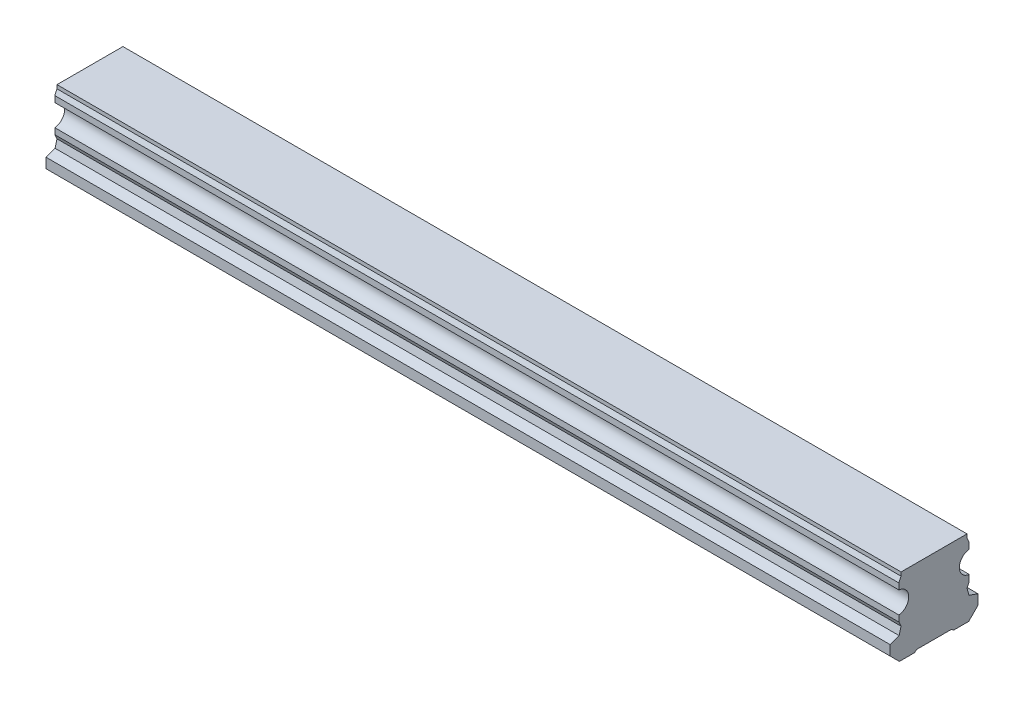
ISO-10303-21;
HEADER;
FILE_DESCRIPTION(('STEP AP214'),'2;1');
FILE_NAME('part.step','',(''),(''),'','','');
FILE_SCHEMA(('AUTOMOTIVE_DESIGN { 1 0 10303 214 1 1 1 1 }'));
ENDSEC;
DATA;
#1=APPLICATION_CONTEXT('core data for automotive mechanical design processes');
#2=APPLICATION_PROTOCOL_DEFINITION('international standard','automotive_design',2000,#1);
#3=PRODUCT_CONTEXT('',#1,'mechanical');
#4=PRODUCT('Part','Part','',(#3));
#5=PRODUCT_RELATED_PRODUCT_CATEGORY('part','',(#4));
#6=PRODUCT_DEFINITION_FORMATION('','',#4);
#7=PRODUCT_DEFINITION_CONTEXT('part definition',#1,'design');
#8=PRODUCT_DEFINITION('design','',#6,#7);
#9=PRODUCT_DEFINITION_SHAPE('','',#8);
#10=(LENGTH_UNIT() NAMED_UNIT(*) SI_UNIT(.MILLI.,.METRE.));
#11=(NAMED_UNIT(*) PLANE_ANGLE_UNIT() SI_UNIT($,.RADIAN.));
#12=(NAMED_UNIT(*) SI_UNIT($,.STERADIAN.) SOLID_ANGLE_UNIT());
#13=UNCERTAINTY_MEASURE_WITH_UNIT(LENGTH_MEASURE(1.E-05),#10,'distance_accuracy_value','');
#14=(GEOMETRIC_REPRESENTATION_CONTEXT(3) GLOBAL_UNCERTAINTY_ASSIGNED_CONTEXT((#13)) GLOBAL_UNIT_ASSIGNED_CONTEXT((#10,
#11,#12)) REPRESENTATION_CONTEXT('',''));
#15=CARTESIAN_POINT('',(0.,0.,0.));
#16=DIRECTION('',(0.,0.,1.));
#17=DIRECTION('',(1.,0.,0.));
#18=AXIS2_PLACEMENT_3D('',#15,#16,#17);
#19=CARTESIAN_POINT('',(210.,0.499999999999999,0.));
#20=DIRECTION('',(0.,-1.,0.));
#21=DIRECTION('',(0.,0.,-1.));
#22=AXIS2_PLACEMENT_3D('',#19,#20,#21);
#23=CONICAL_SURFACE('',#22,3.5,0.785398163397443);
#24=CARTESIAN_POINT('',(210.,1.00000000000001,0.));
#25=DIRECTION('',(0.,1.,0.));
#26=DIRECTION('',(0.,0.,1.));
#27=AXIS2_PLACEMENT_3D('',#24,#25,#26);
#28=CIRCLE('',#27,3.);
#29=CARTESIAN_POINT('',(210.,1.00000000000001,3.));
#30=VERTEX_POINT('',#29);
#31=EDGE_CURVE('E11',#30,#30,#28,.F.);
#32=ORIENTED_EDGE('',*,*,#31,.F.);
#33=EDGE_LOOP('',(#32));
#34=FACE_BOUND('',#33,.T.);
#35=CARTESIAN_POINT('',(210.,0.499999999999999,0.));
#36=DIRECTION('',(0.,1.,0.));
#37=DIRECTION('',(0.,0.,1.));
#38=AXIS2_PLACEMENT_3D('',#35,#36,#37);
#39=CIRCLE('',#38,3.5);
#40=CARTESIAN_POINT('',(210.,0.5,3.5));
#41=VERTEX_POINT('',#40);
#42=EDGE_CURVE('E447',#41,#41,#39,.T.);
#43=ORIENTED_EDGE('',*,*,#42,.F.);
#44=EDGE_LOOP('',(#43));
#45=FACE_BOUND('',#44,.T.);
#46=ADVANCED_FACE('F39',(#34,#45),#23,.F.);
#47=CARTESIAN_POINT('',(210.,12.,0.));
#48=DIRECTION('',(0.,-1.,0.));
#49=DIRECTION('',(0.,0.,-1.));
#50=AXIS2_PLACEMENT_3D('',#47,#48,#49);
#51=CYLINDRICAL_SURFACE('',#50,3.);
#52=ORIENTED_EDGE('',*,*,#31,.T.);
#53=EDGE_LOOP('',(#52));
#54=FACE_BOUND('',#53,.T.);
#55=CARTESIAN_POINT('',(210.,12.,0.));
#56=DIRECTION('',(0.,-1.,0.));
#57=DIRECTION('',(0.,0.,-1.));
#58=AXIS2_PLACEMENT_3D('',#55,#56,#57);
#59=CIRCLE('',#58,3.);
#60=CARTESIAN_POINT('',(210.,12.,-3.));
#61=VERTEX_POINT('',#60);
#62=EDGE_CURVE('E49',#61,#61,#59,.T.);
#63=ORIENTED_EDGE('',*,*,#62,.F.);
#64=EDGE_LOOP('',(#63));
#65=FACE_BOUND('',#64,.T.);
#66=ADVANCED_FACE('F587',(#54,#65),#51,.F.);
#67=CARTESIAN_POINT('',(210.,12.,0.));
#68=DIRECTION('',(0.,-1.,0.));
#69=DIRECTION('',(0.,0.,-1.));
#70=AXIS2_PLACEMENT_3D('',#67,#68,#69);
#71=PLANE('',#70);
#72=CARTESIAN_POINT('',(210.,12.,0.));
#73=DIRECTION('',(0.,-1.,0.));
#74=DIRECTION('',(0.,0.,-1.));
#75=AXIS2_PLACEMENT_3D('',#72,#73,#74);
#76=CIRCLE('',#75,2.5);
#77=CARTESIAN_POINT('',(210.,12.,-2.5));
#78=VERTEX_POINT('',#77);
#79=EDGE_CURVE('E42',#78,#78,#76,.T.);
#80=ORIENTED_EDGE('',*,*,#79,.F.);
#81=EDGE_LOOP('',(#80));
#82=FACE_BOUND('',#81,.T.);
#83=ORIENTED_EDGE('',*,*,#62,.T.);
#84=EDGE_LOOP('',(#83));
#85=FACE_BOUND('',#84,.T.);
#86=ADVANCED_FACE('F592',(#82,#85),#71,.T.);
#87=CARTESIAN_POINT('',(150.,0.499999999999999,0.));
#88=DIRECTION('',(0.,-1.,0.));
#89=DIRECTION('',(0.,0.,-1.));
#90=AXIS2_PLACEMENT_3D('',#87,#88,#89);
#91=CONICAL_SURFACE('',#90,3.5,0.785398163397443);
#92=CARTESIAN_POINT('',(150.,1.00000000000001,0.));
#93=DIRECTION('',(0.,1.,0.));
#94=DIRECTION('',(0.,0.,1.));
#95=AXIS2_PLACEMENT_3D('',#92,#93,#94);
#96=CIRCLE('',#95,3.);
#97=CARTESIAN_POINT('',(150.,1.00000000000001,3.));
#98=VERTEX_POINT('',#97);
#99=EDGE_CURVE('E443',#98,#98,#96,.F.);
#100=ORIENTED_EDGE('',*,*,#99,.F.);
#101=EDGE_LOOP('',(#100));
#102=FACE_BOUND('',#101,.T.);
#103=CARTESIAN_POINT('',(150.,0.499999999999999,0.));
#104=DIRECTION('',(0.,1.,0.));
#105=DIRECTION('',(0.,0.,1.));
#106=AXIS2_PLACEMENT_3D('',#103,#104,#105);
#107=CIRCLE('',#106,3.5);
#108=CARTESIAN_POINT('',(150.,0.5,3.5));
#109=VERTEX_POINT('',#108);
#110=EDGE_CURVE('E435',#109,#109,#107,.T.);
#111=ORIENTED_EDGE('',*,*,#110,.F.);
#112=EDGE_LOOP('',(#111));
#113=FACE_BOUND('',#112,.T.);
#114=ADVANCED_FACE('F679',(#102,#113),#91,.F.);
#115=CARTESIAN_POINT('',(150.,12.,0.));
#116=DIRECTION('',(0.,-1.,0.));
#117=DIRECTION('',(0.,0.,-1.));
#118=AXIS2_PLACEMENT_3D('',#115,#116,#117);
#119=CYLINDRICAL_SURFACE('',#118,3.);
#120=ORIENTED_EDGE('',*,*,#99,.T.);
#121=EDGE_LOOP('',(#120));
#122=FACE_BOUND('',#121,.T.);
#123=CARTESIAN_POINT('',(150.,12.,0.));
#124=DIRECTION('',(0.,-1.,0.));
#125=DIRECTION('',(0.,0.,-1.));
#126=AXIS2_PLACEMENT_3D('',#123,#124,#125);
#127=CIRCLE('',#126,3.);
#128=CARTESIAN_POINT('',(150.,12.,-3.));
#129=VERTEX_POINT('',#128);
#130=EDGE_CURVE('E439',#129,#129,#127,.T.);
#131=ORIENTED_EDGE('',*,*,#130,.F.);
#132=EDGE_LOOP('',(#131));
#133=FACE_BOUND('',#132,.T.);
#134=ADVANCED_FACE('F675',(#122,#133),#119,.F.);
#135=CARTESIAN_POINT('',(150.,12.,0.));
#136=DIRECTION('',(0.,-1.,0.));
#137=DIRECTION('',(0.,0.,-1.));
#138=AXIS2_PLACEMENT_3D('',#135,#136,#137);
#139=PLANE('',#138);
#140=CARTESIAN_POINT('',(150.,12.,0.));
#141=DIRECTION('',(0.,-1.,0.));
#142=DIRECTION('',(0.,0.,-1.));
#143=AXIS2_PLACEMENT_3D('',#140,#141,#142);
#144=CIRCLE('',#143,2.5);
#145=CARTESIAN_POINT('',(150.,12.,-2.5));
#146=VERTEX_POINT('',#145);
#147=EDGE_CURVE('E456',#146,#146,#144,.T.);
#148=ORIENTED_EDGE('',*,*,#147,.F.);
#149=EDGE_LOOP('',(#148));
#150=FACE_BOUND('',#149,.T.);
#151=ORIENTED_EDGE('',*,*,#130,.T.);
#152=EDGE_LOOP('',(#151));
#153=FACE_BOUND('',#152,.T.);
#154=ADVANCED_FACE('F665',(#150,#153),#139,.T.);
#155=CARTESIAN_POINT('',(240.,21.8,-9.375));
#156=DIRECTION('',(0.,0.,1.));
#157=DIRECTION('',(0.,-1.,0.));
#158=AXIS2_PLACEMENT_3D('',#155,#156,#157);
#159=PLANE('',#158);
#160=DIRECTION('',(0.,1.,0.));
#161=VECTOR('',#160,1.);
#162=CARTESIAN_POINT('',(0.,21.8,-9.375));
#163=LINE('',#162,#161);
#164=CARTESIAN_POINT('',(0.,20.756,-9.375));
#165=VERTEX_POINT('',#164);
#166=CARTESIAN_POINT('',(0.,21.8,-9.375));
#167=VERTEX_POINT('',#166);
#168=EDGE_CURVE('E256',#165,#167,#163,.T.);
#169=ORIENTED_EDGE('',*,*,#168,.T.);
#170=DIRECTION('',(-1.,0.,0.));
#171=VECTOR('',#170,1.);
#172=CARTESIAN_POINT('',(240.,21.8,-9.375));
#173=LINE('',#172,#171);
#174=CARTESIAN_POINT('',(240.,21.8,-9.375));
#175=VERTEX_POINT('',#174);
#176=EDGE_CURVE('E424',#175,#167,#173,.T.);
#177=ORIENTED_EDGE('',*,*,#176,.F.);
#178=DIRECTION('',(0.,1.,0.));
#179=VECTOR('',#178,1.);
#180=CARTESIAN_POINT('',(240.,21.8,-9.375));
#181=LINE('',#180,#179);
#182=CARTESIAN_POINT('',(240.,20.756,-9.375));
#183=VERTEX_POINT('',#182);
#184=EDGE_CURVE('E333',#183,#175,#181,.T.);
#185=ORIENTED_EDGE('',*,*,#184,.F.);
#186=DIRECTION('',(-1.,0.,0.));
#187=VECTOR('',#186,1.);
#188=CARTESIAN_POINT('',(240.,20.756,-9.375));
#189=LINE('',#188,#187);
#190=EDGE_CURVE('E252',#183,#165,#189,.T.);
#191=ORIENTED_EDGE('',*,*,#190,.T.);
#192=EDGE_LOOP('',(#169,#177,#185,#191));
#193=FACE_BOUND('',#192,.T.);
#194=ADVANCED_FACE('F662',(#193),#159,.F.);
#195=CARTESIAN_POINT('',(240.,21.8,-9.375));
#196=DIRECTION('',(0.,-1.,0.));
#197=DIRECTION('',(0.,0.,-1.));
#198=AXIS2_PLACEMENT_3D('',#195,#196,#197);
#199=PLANE('',#198);
#200=DIRECTION('',(0.,0.,1.));
#201=VECTOR('',#200,1.);
#202=CARTESIAN_POINT('',(0.,21.8,-9.375));
#203=LINE('',#202,#201);
#204=CARTESIAN_POINT('',(0.,21.8,9.375));
#205=VERTEX_POINT('',#204);
#206=EDGE_CURVE('E260',#167,#205,#203,.T.);
#207=ORIENTED_EDGE('',*,*,#206,.T.);
#208=DIRECTION('',(-1.,0.,0.));
#209=VECTOR('',#208,1.);
#210=CARTESIAN_POINT('',(240.,21.8,9.375));
#211=LINE('',#210,#209);
#212=CARTESIAN_POINT('',(240.,21.8,9.375));
#213=VERTEX_POINT('',#212);
#214=EDGE_CURVE('E420',#213,#205,#211,.T.);
#215=ORIENTED_EDGE('',*,*,#214,.F.);
#216=DIRECTION('',(0.,0.,1.));
#217=VECTOR('',#216,1.);
#218=CARTESIAN_POINT('',(240.,21.8,-9.375));
#219=LINE('',#218,#217);
#220=EDGE_CURVE('E157',#175,#213,#219,.T.);
#221=ORIENTED_EDGE('',*,*,#220,.F.);
#222=ORIENTED_EDGE('',*,*,#176,.T.);
#223=EDGE_LOOP('',(#207,#215,#221,#222));
#224=FACE_BOUND('',#223,.T.);
#225=ADVANCED_FACE('F658',(#224),#199,.F.);
#226=CARTESIAN_POINT('',(240.,21.8,9.375));
#227=DIRECTION('',(0.,0.,-1.));
#228=DIRECTION('',(0.,1.,0.));
#229=AXIS2_PLACEMENT_3D('',#226,#227,#228);
#230=PLANE('',#229);
#231=DIRECTION('',(0.,-1.,0.));
#232=VECTOR('',#231,1.);
#233=CARTESIAN_POINT('',(0.,21.8,9.375));
#234=LINE('',#233,#232);
#235=CARTESIAN_POINT('',(0.,20.756,9.37499999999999));
#236=VERTEX_POINT('',#235);
#237=EDGE_CURVE('E264',#205,#236,#234,.T.);
#238=ORIENTED_EDGE('',*,*,#237,.T.);
#239=DIRECTION('',(-1.,0.,0.));
#240=VECTOR('',#239,1.);
#241=CARTESIAN_POINT('',(240.,20.756,9.37499999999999));
#242=LINE('',#241,#240);
#243=CARTESIAN_POINT('',(240.,20.756,9.37499999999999));
#244=VERTEX_POINT('',#243);
#245=EDGE_CURVE('E416',#244,#236,#242,.T.);
#246=ORIENTED_EDGE('',*,*,#245,.F.);
#247=DIRECTION('',(0.,-1.,0.));
#248=VECTOR('',#247,1.);
#249=CARTESIAN_POINT('',(240.,21.8,9.375));
#250=LINE('',#249,#248);
#251=EDGE_CURVE('E500',#213,#244,#250,.T.);
#252=ORIENTED_EDGE('',*,*,#251,.F.);
#253=ORIENTED_EDGE('',*,*,#214,.T.);
#254=EDGE_LOOP('',(#238,#246,#252,#253));
#255=FACE_BOUND('',#254,.T.);
#256=ADVANCED_FACE('F654',(#255),#230,.F.);
#257=CARTESIAN_POINT('',(240.,20.756,9.37499999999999));
#258=DIRECTION('',(0.,-0.422618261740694,-0.906307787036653));
#259=DIRECTION('',(0.,0.906307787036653,-0.422618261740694));
#260=AXIS2_PLACEMENT_3D('',#257,#258,#259);
#261=PLANE('',#260);
#262=DIRECTION('',(0.,-0.906307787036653,0.422618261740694));
#263=VECTOR('',#262,1.);
#264=CARTESIAN_POINT('',(0.,20.756,9.37499999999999));
#265=LINE('',#264,#263);
#266=CARTESIAN_POINT('',(0.,19.4156831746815,10.));
#267=VERTEX_POINT('',#266);
#268=EDGE_CURVE('E267',#236,#267,#265,.T.);
#269=ORIENTED_EDGE('',*,*,#268,.T.);
#270=DIRECTION('',(-1.,0.,0.));
#271=VECTOR('',#270,1.);
#272=CARTESIAN_POINT('',(240.,19.4156831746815,10.));
#273=LINE('',#272,#271);
#274=CARTESIAN_POINT('',(240.,19.4156831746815,10.));
#275=VERTEX_POINT('',#274);
#276=EDGE_CURVE('E412',#275,#267,#273,.T.);
#277=ORIENTED_EDGE('',*,*,#276,.F.);
#278=DIRECTION('',(0.,-0.906307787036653,0.422618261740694));
#279=VECTOR('',#278,1.);
#280=CARTESIAN_POINT('',(240.,20.756,9.37499999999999));
#281=LINE('',#280,#279);
#282=EDGE_CURVE('E503',#244,#275,#281,.T.);
#283=ORIENTED_EDGE('',*,*,#282,.F.);
#284=ORIENTED_EDGE('',*,*,#245,.T.);
#285=EDGE_LOOP('',(#269,#277,#283,#284));
#286=FACE_BOUND('',#285,.T.);
#287=ADVANCED_FACE('F650',(#286),#261,.F.);
#288=CARTESIAN_POINT('',(240.,19.4156831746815,10.));
#289=DIRECTION('',(0.,0.,-1.));
#290=DIRECTION('',(-1.,0.,0.));
#291=AXIS2_PLACEMENT_3D('',#288,#289,#290);
#292=PLANE('',#291);
#293=DIRECTION('',(0.,-1.,0.));
#294=VECTOR('',#293,1.);
#295=CARTESIAN_POINT('',(0.,19.4156831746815,10.));
#296=LINE('',#295,#294);
#297=CARTESIAN_POINT('',(0.,17.6854497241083,10.));
#298=VERTEX_POINT('',#297);
#299=EDGE_CURVE('E270',#267,#298,#296,.T.);
#300=ORIENTED_EDGE('',*,*,#299,.T.);
#301=DIRECTION('',(-1.,0.,0.));
#302=VECTOR('',#301,1.);
#303=CARTESIAN_POINT('',(240.,17.6854497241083,10.));
#304=LINE('',#303,#302);
#305=CARTESIAN_POINT('',(240.,17.6854497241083,10.));
#306=VERTEX_POINT('',#305);
#307=EDGE_CURVE('E408',#306,#298,#304,.T.);
#308=ORIENTED_EDGE('',*,*,#307,.F.);
#309=DIRECTION('',(0.,-1.,0.));
#310=VECTOR('',#309,1.);
#311=CARTESIAN_POINT('',(240.,19.4156831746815,10.));
#312=LINE('',#311,#310);
#313=EDGE_CURVE('E506',#275,#306,#312,.T.);
#314=ORIENTED_EDGE('',*,*,#313,.F.);
#315=ORIENTED_EDGE('',*,*,#276,.T.);
#316=EDGE_LOOP('',(#300,#308,#314,#315));
#317=FACE_BOUND('',#316,.T.);
#318=ADVANCED_FACE('F646',(#317),#292,.F.);
#319=CARTESIAN_POINT('',(240.,14.6,10.3));
#320=DIRECTION('',(-1.,0.,0.));
#321=DIRECTION('',(0.,0.,1.));
#322=AXIS2_PLACEMENT_3D('',#319,#320,#321);
#323=CYLINDRICAL_SURFACE('',#322,3.1);
#324=CARTESIAN_POINT('',(0.,14.6,10.3));
#325=DIRECTION('',(-1.,0.,0.));
#326=DIRECTION('',(0.,0.,-1.));
#327=AXIS2_PLACEMENT_3D('',#324,#325,#326);
#328=CIRCLE('',#327,3.1);
#329=CARTESIAN_POINT('',(0.,11.5145502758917,10.));
#330=VERTEX_POINT('',#329);
#331=EDGE_CURVE('E273',#298,#330,#328,.T.);
#332=ORIENTED_EDGE('',*,*,#331,.T.);
#333=DIRECTION('',(-1.,0.,0.));
#334=VECTOR('',#333,1.);
#335=CARTESIAN_POINT('',(240.,11.5145502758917,10.));
#336=LINE('',#335,#334);
#337=CARTESIAN_POINT('',(240.,11.5145502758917,10.));
#338=VERTEX_POINT('',#337);
#339=EDGE_CURVE('E404',#338,#330,#336,.T.);
#340=ORIENTED_EDGE('',*,*,#339,.F.);
#341=CARTESIAN_POINT('',(240.,14.6,10.3));
#342=DIRECTION('',(-1.,0.,0.));
#343=DIRECTION('',(0.,0.,-1.));
#344=AXIS2_PLACEMENT_3D('',#341,#342,#343);
#345=CIRCLE('',#344,3.1);
#346=EDGE_CURVE('E509',#306,#338,#345,.T.);
#347=ORIENTED_EDGE('',*,*,#346,.F.);
#348=ORIENTED_EDGE('',*,*,#307,.T.);
#349=EDGE_LOOP('',(#332,#340,#347,#348));
#350=FACE_BOUND('',#349,.T.);
#351=ADVANCED_FACE('F642',(#350),#323,.F.);
#352=CARTESIAN_POINT('',(240.,9.78431682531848,10.));
#353=DIRECTION('',(0.,0.,-1.));
#354=DIRECTION('',(0.,1.,0.));
#355=AXIS2_PLACEMENT_3D('',#352,#353,#354);
#356=PLANE('',#355);
#357=DIRECTION('',(0.,-1.,0.));
#358=VECTOR('',#357,1.);
#359=CARTESIAN_POINT('',(0.,9.78431682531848,10.));
#360=LINE('',#359,#358);
#361=CARTESIAN_POINT('',(0.,9.78431682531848,10.));
#362=VERTEX_POINT('',#361);
#363=EDGE_CURVE('E276',#330,#362,#360,.T.);
#364=ORIENTED_EDGE('',*,*,#363,.T.);
#365=DIRECTION('',(-1.,0.,0.));
#366=VECTOR('',#365,1.);
#367=CARTESIAN_POINT('',(240.,9.78431682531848,10.));
#368=LINE('',#367,#366);
#369=CARTESIAN_POINT('',(240.,9.78431682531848,10.));
#370=VERTEX_POINT('',#369);
#371=EDGE_CURVE('E400',#370,#362,#368,.T.);
#372=ORIENTED_EDGE('',*,*,#371,.F.);
#373=DIRECTION('',(0.,-1.,0.));
#374=VECTOR('',#373,1.);
#375=CARTESIAN_POINT('',(240.,9.78431682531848,10.));
#376=LINE('',#375,#374);
#377=EDGE_CURVE('E512',#338,#370,#376,.T.);
#378=ORIENTED_EDGE('',*,*,#377,.F.);
#379=ORIENTED_EDGE('',*,*,#339,.T.);
#380=EDGE_LOOP('',(#364,#372,#378,#379));
#381=FACE_BOUND('',#380,.T.);
#382=ADVANCED_FACE('F638',(#381),#356,.F.);
#383=CARTESIAN_POINT('',(240.,8.44400000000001,9.375));
#384=DIRECTION('',(0.,0.4226182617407,-0.90630778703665));
#385=DIRECTION('',(0.,0.90630778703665,0.4226182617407));
#386=AXIS2_PLACEMENT_3D('',#383,#384,#385);
#387=PLANE('',#386);
#388=DIRECTION('',(0.,-0.90630778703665,-0.4226182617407));
#389=VECTOR('',#388,1.);
#390=CARTESIAN_POINT('',(0.,8.44400000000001,9.375));
#391=LINE('',#390,#389);
#392=CARTESIAN_POINT('',(0.,8.44400000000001,9.375));
#393=VERTEX_POINT('',#392);
#394=EDGE_CURVE('E279',#362,#393,#391,.T.);
#395=ORIENTED_EDGE('',*,*,#394,.T.);
#396=DIRECTION('',(-1.,0.,0.));
#397=VECTOR('',#396,1.);
#398=CARTESIAN_POINT('',(240.,8.44400000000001,9.375));
#399=LINE('',#398,#397);
#400=CARTESIAN_POINT('',(240.,8.44400000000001,9.375));
#401=VERTEX_POINT('',#400);
#402=EDGE_CURVE('E396',#401,#393,#399,.T.);
#403=ORIENTED_EDGE('',*,*,#402,.F.);
#404=DIRECTION('',(0.,-0.90630778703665,-0.4226182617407));
#405=VECTOR('',#404,1.);
#406=CARTESIAN_POINT('',(240.,8.44400000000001,9.375));
#407=LINE('',#406,#405);
#408=EDGE_CURVE('E515',#370,#401,#407,.T.);
#409=ORIENTED_EDGE('',*,*,#408,.F.);
#410=ORIENTED_EDGE('',*,*,#371,.T.);
#411=EDGE_LOOP('',(#395,#403,#409,#410));
#412=FACE_BOUND('',#411,.T.);
#413=ADVANCED_FACE('F634',(#412),#387,.F.);
#414=CARTESIAN_POINT('',(240.,6.4,9.92268814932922));
#415=DIRECTION('',(0.,-0.258819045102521,-0.965925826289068));
#416=DIRECTION('',(0.,0.965925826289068,-0.258819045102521));
#417=AXIS2_PLACEMENT_3D('',#414,#415,#416);
#418=PLANE('',#417);
#419=DIRECTION('',(0.,-0.965925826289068,0.258819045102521));
#420=VECTOR('',#419,1.);
#421=CARTESIAN_POINT('',(0.,6.4,9.92268814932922));
#422=LINE('',#421,#420);
#423=CARTESIAN_POINT('',(0.,6.4,9.92268814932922));
#424=VERTEX_POINT('',#423);
#425=EDGE_CURVE('E282',#393,#424,#422,.T.);
#426=ORIENTED_EDGE('',*,*,#425,.T.);
#427=DIRECTION('',(-1.,0.,0.));
#428=VECTOR('',#427,1.);
#429=CARTESIAN_POINT('',(240.,6.4,9.92268814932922));
#430=LINE('',#429,#428);
#431=CARTESIAN_POINT('',(240.,6.4,9.92268814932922));
#432=VERTEX_POINT('',#431);
#433=EDGE_CURVE('E392',#432,#424,#430,.T.);
#434=ORIENTED_EDGE('',*,*,#433,.F.);
#435=DIRECTION('',(0.,-0.965925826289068,0.258819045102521));
#436=VECTOR('',#435,1.);
#437=CARTESIAN_POINT('',(240.,6.4,9.92268814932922));
#438=LINE('',#437,#436);
#439=EDGE_CURVE('E518',#401,#432,#438,.T.);
#440=ORIENTED_EDGE('',*,*,#439,.F.);
#441=ORIENTED_EDGE('',*,*,#402,.T.);
#442=EDGE_LOOP('',(#426,#434,#440,#441));
#443=FACE_BOUND('',#442,.T.);
#444=ADVANCED_FACE('F630',(#443),#418,.F.);
#445=CARTESIAN_POINT('',(240.,5.48933857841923,12.5));
#446=DIRECTION('',(0.,-0.942872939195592,-0.333152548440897));
#447=DIRECTION('',(0.,0.333152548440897,-0.942872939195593));
#448=AXIS2_PLACEMENT_3D('',#445,#446,#447);
#449=PLANE('',#448);
#450=DIRECTION('',(0.,-0.333152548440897,0.942872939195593));
#451=VECTOR('',#450,1.);
#452=CARTESIAN_POINT('',(0.,5.48933857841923,12.5));
#453=LINE('',#452,#451);
#454=CARTESIAN_POINT('',(0.,5.48933857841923,12.5));
#455=VERTEX_POINT('',#454);
#456=EDGE_CURVE('E285',#424,#455,#453,.T.);
#457=ORIENTED_EDGE('',*,*,#456,.T.);
#458=DIRECTION('',(-1.,0.,0.));
#459=VECTOR('',#458,1.);
#460=CARTESIAN_POINT('',(240.,5.48933857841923,12.5));
#461=LINE('',#460,#459);
#462=CARTESIAN_POINT('',(240.,5.48933857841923,12.5));
#463=VERTEX_POINT('',#462);
#464=EDGE_CURVE('E388',#463,#455,#461,.T.);
#465=ORIENTED_EDGE('',*,*,#464,.F.);
#466=DIRECTION('',(0.,-0.333152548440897,0.942872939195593));
#467=VECTOR('',#466,1.);
#468=CARTESIAN_POINT('',(240.,5.48933857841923,12.5));
#469=LINE('',#468,#467);
#470=EDGE_CURVE('E521',#432,#463,#469,.T.);
#471=ORIENTED_EDGE('',*,*,#470,.F.);
#472=ORIENTED_EDGE('',*,*,#433,.T.);
#473=EDGE_LOOP('',(#457,#465,#471,#472));
#474=FACE_BOUND('',#473,.T.);
#475=ADVANCED_FACE('F626',(#474),#449,.F.);
#476=CARTESIAN_POINT('',(240.,2.65,12.5));
#477=DIRECTION('',(0.,0.,-1.));
#478=DIRECTION('',(0.,1.,0.));
#479=AXIS2_PLACEMENT_3D('',#476,#477,#478);
#480=PLANE('',#479);
#481=DIRECTION('',(0.,-1.,0.));
#482=VECTOR('',#481,1.);
#483=CARTESIAN_POINT('',(0.,2.65,12.5));
#484=LINE('',#483,#482);
#485=CARTESIAN_POINT('',(0.,2.65,12.5));
#486=VERTEX_POINT('',#485);
#487=EDGE_CURVE('E288',#455,#486,#484,.T.);
#488=ORIENTED_EDGE('',*,*,#487,.T.);
#489=DIRECTION('',(-1.,0.,0.));
#490=VECTOR('',#489,1.);
#491=CARTESIAN_POINT('',(240.,2.65,12.5));
#492=LINE('',#491,#490);
#493=CARTESIAN_POINT('',(240.,2.65,12.5));
#494=VERTEX_POINT('',#493);
#495=EDGE_CURVE('E384',#494,#486,#492,.T.);
#496=ORIENTED_EDGE('',*,*,#495,.F.);
#497=DIRECTION('',(0.,-1.,0.));
#498=VECTOR('',#497,1.);
#499=CARTESIAN_POINT('',(240.,2.65,12.5));
#500=LINE('',#499,#498);
#501=EDGE_CURVE('E524',#463,#494,#500,.T.);
#502=ORIENTED_EDGE('',*,*,#501,.F.);
#503=ORIENTED_EDGE('',*,*,#464,.T.);
#504=EDGE_LOOP('',(#488,#496,#502,#503));
#505=FACE_BOUND('',#504,.T.);
#506=ADVANCED_FACE('F622',(#505),#480,.F.);
#507=CARTESIAN_POINT('',(240.,0.,9.85));
#508=DIRECTION('',(0.,0.707106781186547,-0.707106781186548));
#509=DIRECTION('',(0.,0.707106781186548,0.707106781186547));
#510=AXIS2_PLACEMENT_3D('',#507,#508,#509);
#511=PLANE('',#510);
#512=DIRECTION('',(0.,-0.707106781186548,-0.707106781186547));
#513=VECTOR('',#512,1.);
#514=CARTESIAN_POINT('',(0.,0.,9.85));
#515=LINE('',#514,#513);
#516=CARTESIAN_POINT('',(0.,0.,9.85));
#517=VERTEX_POINT('',#516);
#518=EDGE_CURVE('E291',#486,#517,#515,.T.);
#519=ORIENTED_EDGE('',*,*,#518,.T.);
#520=DIRECTION('',(-1.,0.,0.));
#521=VECTOR('',#520,1.);
#522=CARTESIAN_POINT('',(240.,0.,9.85));
#523=LINE('',#522,#521);
#524=CARTESIAN_POINT('',(240.,0.,9.85));
#525=VERTEX_POINT('',#524);
#526=EDGE_CURVE('E380',#525,#517,#523,.T.);
#527=ORIENTED_EDGE('',*,*,#526,.F.);
#528=DIRECTION('',(0.,-0.707106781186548,-0.707106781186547));
#529=VECTOR('',#528,1.);
#530=CARTESIAN_POINT('',(240.,0.,9.85));
#531=LINE('',#530,#529);
#532=EDGE_CURVE('E527',#494,#525,#531,.T.);
#533=ORIENTED_EDGE('',*,*,#532,.F.);
#534=ORIENTED_EDGE('',*,*,#495,.T.);
#535=EDGE_LOOP('',(#519,#527,#533,#534));
#536=FACE_BOUND('',#535,.T.);
#537=ADVANCED_FACE('F618',(#536),#511,.F.);
#538=CARTESIAN_POINT('',(240.,0.,5.5));
#539=DIRECTION('',(0.,1.,0.));
#540=DIRECTION('',(0.,0.,1.));
#541=AXIS2_PLACEMENT_3D('',#538,#539,#540);
#542=PLANE('',#541);
#543=DIRECTION('',(0.,0.,-1.));
#544=VECTOR('',#543,1.);
#545=CARTESIAN_POINT('',(0.,0.,5.5));
#546=LINE('',#545,#544);
#547=CARTESIAN_POINT('',(0.,0.,5.5));
#548=VERTEX_POINT('',#547);
#549=EDGE_CURVE('E294',#517,#548,#546,.T.);
#550=ORIENTED_EDGE('',*,*,#549,.T.);
#551=DIRECTION('',(-1.,0.,0.));
#552=VECTOR('',#551,1.);
#553=CARTESIAN_POINT('',(240.,0.,5.5));
#554=LINE('',#553,#552);
#555=CARTESIAN_POINT('',(240.,0.,5.5));
#556=VERTEX_POINT('',#555);
#557=EDGE_CURVE('E376',#556,#548,#554,.T.);
#558=ORIENTED_EDGE('',*,*,#557,.F.);
#559=DIRECTION('',(0.,0.,-1.));
#560=VECTOR('',#559,1.);
#561=CARTESIAN_POINT('',(240.,0.,5.5));
#562=LINE('',#561,#560);
#563=EDGE_CURVE('E530',#525,#556,#562,.T.);
#564=ORIENTED_EDGE('',*,*,#563,.F.);
#565=ORIENTED_EDGE('',*,*,#526,.T.);
#566=EDGE_LOOP('',(#550,#558,#564,#565));
#567=FACE_BOUND('',#566,.T.);
#568=ADVANCED_FACE('F610',(#567),#542,.F.);
#569=CARTESIAN_POINT('',(240.,0.5,5.));
#570=DIRECTION('',(0.,0.707106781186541,0.707106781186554));
#571=DIRECTION('',(0.,-0.707106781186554,0.707106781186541));
#572=AXIS2_PLACEMENT_3D('',#569,#570,#571);
#573=PLANE('',#572);
#574=DIRECTION('',(0.,0.707106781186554,-0.707106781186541));
#575=VECTOR('',#574,1.);
#576=CARTESIAN_POINT('',(0.,0.5,5.));
#577=LINE('',#576,#575);
#578=CARTESIAN_POINT('',(0.,0.5,5.));
#579=VERTEX_POINT('',#578);
#580=EDGE_CURVE('E297',#548,#579,#577,.T.);
#581=ORIENTED_EDGE('',*,*,#580,.T.);
#582=DIRECTION('',(-1.,0.,0.));
#583=VECTOR('',#582,1.);
#584=CARTESIAN_POINT('',(240.,0.5,5.));
#585=LINE('',#584,#583);
#586=CARTESIAN_POINT('',(240.,0.5,5.));
#587=VERTEX_POINT('',#586);
#588=EDGE_CURVE('E372',#587,#579,#585,.T.);
#589=ORIENTED_EDGE('',*,*,#588,.F.);
#590=DIRECTION('',(0.,0.707106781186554,-0.707106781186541));
#591=VECTOR('',#590,1.);
#592=CARTESIAN_POINT('',(240.,0.5,5.));
#593=LINE('',#592,#591);
#594=EDGE_CURVE('E532',#556,#587,#593,.T.);
#595=ORIENTED_EDGE('',*,*,#594,.F.);
#596=ORIENTED_EDGE('',*,*,#557,.T.);
#597=EDGE_LOOP('',(#581,#589,#595,#596));
#598=FACE_BOUND('',#597,.T.);
#599=ADVANCED_FACE('F601',(#598),#573,.F.);
#600=CARTESIAN_POINT('',(240.,0.499999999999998,-5.));
#601=DIRECTION('',(0.,1.,0.));
#602=DIRECTION('',(0.,0.,1.));
#603=AXIS2_PLACEMENT_3D('',#600,#601,#602);
#604=PLANE('',#603);
#605=CARTESIAN_POINT('',(90.,0.499999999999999,0.));
#606=DIRECTION('',(0.,1.,0.));
#607=DIRECTION('',(0.,0.,1.));
#608=AXIS2_PLACEMENT_3D('',#605,#606,#607);
#609=CIRCLE('',#608,3.5);
#610=CARTESIAN_POINT('',(90.,0.5,3.5));
#611=VERTEX_POINT('',#610);
#612=EDGE_CURVE('E465',#611,#611,#609,.T.);
#613=ORIENTED_EDGE('',*,*,#612,.T.);
#614=EDGE_LOOP('',(#613));
#615=FACE_BOUND('',#614,.T.);
#616=CARTESIAN_POINT('',(30.,0.499999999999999,0.));
#617=DIRECTION('',(0.,1.,0.));
#618=DIRECTION('',(0.,0.,1.));
#619=AXIS2_PLACEMENT_3D('',#616,#617,#618);
#620=CIRCLE('',#619,3.5);
#621=CARTESIAN_POINT('',(30.,0.5,3.5));
#622=VERTEX_POINT('',#621);
#623=EDGE_CURVE('E427',#622,#622,#620,.T.);
#624=ORIENTED_EDGE('',*,*,#623,.T.);
#625=EDGE_LOOP('',(#624));
#626=FACE_BOUND('',#625,.T.);
#627=DIRECTION('',(0.,0.,-1.));
#628=VECTOR('',#627,1.);
#629=CARTESIAN_POINT('',(0.,0.499999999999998,-5.));
#630=LINE('',#629,#628);
#631=CARTESIAN_POINT('',(0.,0.499999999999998,-5.));
#632=VERTEX_POINT('',#631);
#633=EDGE_CURVE('E300',#579,#632,#630,.T.);
#634=ORIENTED_EDGE('',*,*,#633,.T.);
#635=DIRECTION('',(-1.,0.,0.));
#636=VECTOR('',#635,1.);
#637=CARTESIAN_POINT('',(240.,0.499999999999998,-5.));
#638=LINE('',#637,#636);
#639=CARTESIAN_POINT('',(240.,0.499999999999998,-5.));
#640=VERTEX_POINT('',#639);
#641=EDGE_CURVE('E368',#640,#632,#638,.T.);
#642=ORIENTED_EDGE('',*,*,#641,.F.);
#643=DIRECTION('',(0.,0.,-1.));
#644=VECTOR('',#643,1.);
#645=CARTESIAN_POINT('',(240.,0.499999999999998,-5.));
#646=LINE('',#645,#644);
#647=EDGE_CURVE('E535',#587,#640,#646,.T.);
#648=ORIENTED_EDGE('',*,*,#647,.F.);
#649=ORIENTED_EDGE('',*,*,#588,.T.);
#650=EDGE_LOOP('',(#634,#642,#648,#649));
#651=FACE_BOUND('',#650,.T.);
#652=ORIENTED_EDGE('',*,*,#110,.T.);
#653=EDGE_LOOP('',(#652));
#654=FACE_BOUND('',#653,.T.);
#655=ORIENTED_EDGE('',*,*,#42,.T.);
#656=EDGE_LOOP('',(#655));
#657=FACE_BOUND('',#656,.T.);
#658=ADVANCED_FACE('F598',(#615,#626,#651,#654,#657),#604,.F.);
#659=CARTESIAN_POINT('',(240.,0.,-5.5));
#660=DIRECTION('',(0.,0.707106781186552,-0.707106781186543));
#661=DIRECTION('',(0.,0.707106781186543,0.707106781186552));
#662=AXIS2_PLACEMENT_3D('',#659,#660,#661);
#663=PLANE('',#662);
#664=DIRECTION('',(0.,-0.707106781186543,-0.707106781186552));
#665=VECTOR('',#664,1.);
#666=CARTESIAN_POINT('',(0.,0.,-5.5));
#667=LINE('',#666,#665);
#668=CARTESIAN_POINT('',(0.,0.,-5.5));
#669=VERTEX_POINT('',#668);
#670=EDGE_CURVE('E303',#632,#669,#667,.T.);
#671=ORIENTED_EDGE('',*,*,#670,.T.);
#672=DIRECTION('',(-1.,0.,0.));
#673=VECTOR('',#672,1.);
#674=CARTESIAN_POINT('',(240.,0.,-5.5));
#675=LINE('',#674,#673);
#676=CARTESIAN_POINT('',(240.,0.,-5.5));
#677=VERTEX_POINT('',#676);
#678=EDGE_CURVE('E364',#677,#669,#675,.T.);
#679=ORIENTED_EDGE('',*,*,#678,.F.);
#680=DIRECTION('',(0.,-0.707106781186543,-0.707106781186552));
#681=VECTOR('',#680,1.);
#682=CARTESIAN_POINT('',(240.,0.,-5.5));
#683=LINE('',#682,#681);
#684=EDGE_CURVE('E538',#640,#677,#683,.T.);
#685=ORIENTED_EDGE('',*,*,#684,.F.);
#686=ORIENTED_EDGE('',*,*,#641,.T.);
#687=EDGE_LOOP('',(#671,#679,#685,#686));
#688=FACE_BOUND('',#687,.T.);
#689=ADVANCED_FACE('F600',(#688),#663,.F.);
#690=CARTESIAN_POINT('',(240.,0.,-9.85));
#691=DIRECTION('',(0.,1.,0.));
#692=DIRECTION('',(0.,0.,1.));
#693=AXIS2_PLACEMENT_3D('',#690,#691,#692);
#694=PLANE('',#693);
#695=DIRECTION('',(0.,0.,-1.));
#696=VECTOR('',#695,1.);
#697=CARTESIAN_POINT('',(0.,0.,-9.85));
#698=LINE('',#697,#696);
#699=CARTESIAN_POINT('',(0.,0.,-9.85));
#700=VERTEX_POINT('',#699);
#701=EDGE_CURVE('E306',#669,#700,#698,.T.);
#702=ORIENTED_EDGE('',*,*,#701,.T.);
#703=DIRECTION('',(-1.,0.,0.));
#704=VECTOR('',#703,1.);
#705=CARTESIAN_POINT('',(240.,0.,-9.85));
#706=LINE('',#705,#704);
#707=CARTESIAN_POINT('',(240.,0.,-9.85));
#708=VERTEX_POINT('',#707);
#709=EDGE_CURVE('E360',#708,#700,#706,.T.);
#710=ORIENTED_EDGE('',*,*,#709,.F.);
#711=DIRECTION('',(0.,0.,-1.));
#712=VECTOR('',#711,1.);
#713=CARTESIAN_POINT('',(240.,0.,-9.85));
#714=LINE('',#713,#712);
#715=EDGE_CURVE('E541',#677,#708,#714,.T.);
#716=ORIENTED_EDGE('',*,*,#715,.F.);
#717=ORIENTED_EDGE('',*,*,#678,.T.);
#718=EDGE_LOOP('',(#702,#710,#716,#717));
#719=FACE_BOUND('',#718,.T.);
#720=ADVANCED_FACE('F607',(#719),#694,.F.);
#721=CARTESIAN_POINT('',(240.,2.65,-12.5));
#722=DIRECTION('',(0.,0.707106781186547,0.707106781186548));
#723=DIRECTION('',(0.,-0.707106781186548,0.707106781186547));
#724=AXIS2_PLACEMENT_3D('',#721,#722,#723);
#725=PLANE('',#724);
#726=DIRECTION('',(0.,0.707106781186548,-0.707106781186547));
#727=VECTOR('',#726,1.);
#728=CARTESIAN_POINT('',(0.,2.65,-12.5));
#729=LINE('',#728,#727);
#730=CARTESIAN_POINT('',(0.,2.65,-12.5));
#731=VERTEX_POINT('',#730);
#732=EDGE_CURVE('E309',#700,#731,#729,.T.);
#733=ORIENTED_EDGE('',*,*,#732,.T.);
#734=DIRECTION('',(-1.,0.,0.));
#735=VECTOR('',#734,1.);
#736=CARTESIAN_POINT('',(240.,2.65,-12.5));
#737=LINE('',#736,#735);
#738=CARTESIAN_POINT('',(240.,2.65,-12.5));
#739=VERTEX_POINT('',#738);
#740=EDGE_CURVE('E356',#739,#731,#737,.T.);
#741=ORIENTED_EDGE('',*,*,#740,.F.);
#742=DIRECTION('',(0.,0.707106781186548,-0.707106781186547));
#743=VECTOR('',#742,1.);
#744=CARTESIAN_POINT('',(240.,2.65,-12.5));
#745=LINE('',#744,#743);
#746=EDGE_CURVE('E544',#708,#739,#745,.T.);
#747=ORIENTED_EDGE('',*,*,#746,.F.);
#748=ORIENTED_EDGE('',*,*,#709,.T.);
#749=EDGE_LOOP('',(#733,#741,#747,#748));
#750=FACE_BOUND('',#749,.T.);
#751=ADVANCED_FACE('F760',(#750),#725,.F.);
#752=CARTESIAN_POINT('',(240.,5.48933857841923,-12.5));
#753=DIRECTION('',(0.,0.,1.));
#754=DIRECTION('',(0.,-1.,0.));
#755=AXIS2_PLACEMENT_3D('',#752,#753,#754);
#756=PLANE('',#755);
#757=DIRECTION('',(0.,1.,0.));
#758=VECTOR('',#757,1.);
#759=CARTESIAN_POINT('',(0.,5.48933857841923,-12.5));
#760=LINE('',#759,#758);
#761=CARTESIAN_POINT('',(0.,5.48933857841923,-12.5));
#762=VERTEX_POINT('',#761);
#763=EDGE_CURVE('E312',#731,#762,#760,.T.);
#764=ORIENTED_EDGE('',*,*,#763,.T.);
#765=DIRECTION('',(-1.,0.,0.));
#766=VECTOR('',#765,1.);
#767=CARTESIAN_POINT('',(240.,5.48933857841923,-12.5));
#768=LINE('',#767,#766);
#769=CARTESIAN_POINT('',(240.,5.48933857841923,-12.5));
#770=VERTEX_POINT('',#769);
#771=EDGE_CURVE('E352',#770,#762,#768,.T.);
#772=ORIENTED_EDGE('',*,*,#771,.F.);
#773=DIRECTION('',(0.,1.,0.));
#774=VECTOR('',#773,1.);
#775=CARTESIAN_POINT('',(240.,5.48933857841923,-12.5));
#776=LINE('',#775,#774);
#777=EDGE_CURVE('E547',#739,#770,#776,.T.);
#778=ORIENTED_EDGE('',*,*,#777,.F.);
#779=ORIENTED_EDGE('',*,*,#740,.T.);
#780=EDGE_LOOP('',(#764,#772,#778,#779));
#781=FACE_BOUND('',#780,.T.);
#782=ADVANCED_FACE('F768',(#781),#756,.F.);
#783=CARTESIAN_POINT('',(240.,6.39999999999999,-9.92268814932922));
#784=DIRECTION('',(0.,-0.942872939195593,0.333152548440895));
#785=DIRECTION('',(0.,-0.333152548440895,-0.942872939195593));
#786=AXIS2_PLACEMENT_3D('',#783,#784,#785);
#787=PLANE('',#786);
#788=DIRECTION('',(0.,0.333152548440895,0.942872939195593));
#789=VECTOR('',#788,1.);
#790=CARTESIAN_POINT('',(0.,6.39999999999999,-9.92268814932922));
#791=LINE('',#790,#789);
#792=CARTESIAN_POINT('',(0.,6.39999999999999,-9.92268814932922));
#793=VERTEX_POINT('',#792);
#794=EDGE_CURVE('E315',#762,#793,#791,.T.);
#795=ORIENTED_EDGE('',*,*,#794,.T.);
#796=DIRECTION('',(-1.,0.,0.));
#797=VECTOR('',#796,1.);
#798=CARTESIAN_POINT('',(240.,6.39999999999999,-9.92268814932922));
#799=LINE('',#798,#797);
#800=CARTESIAN_POINT('',(240.,6.39999999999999,-9.92268814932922));
#801=VERTEX_POINT('',#800);
#802=EDGE_CURVE('E348',#801,#793,#799,.T.);
#803=ORIENTED_EDGE('',*,*,#802,.F.);
#804=DIRECTION('',(0.,0.333152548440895,0.942872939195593));
#805=VECTOR('',#804,1.);
#806=CARTESIAN_POINT('',(240.,6.39999999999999,-9.92268814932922));
#807=LINE('',#806,#805);
#808=EDGE_CURVE('E550',#770,#801,#807,.T.);
#809=ORIENTED_EDGE('',*,*,#808,.F.);
#810=ORIENTED_EDGE('',*,*,#771,.T.);
#811=EDGE_LOOP('',(#795,#803,#809,#810));
#812=FACE_BOUND('',#811,.T.);
#813=ADVANCED_FACE('F777',(#812),#787,.F.);
#814=CARTESIAN_POINT('',(240.,8.44400000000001,-9.375));
#815=DIRECTION('',(0.,-0.258819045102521,0.965925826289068));
#816=DIRECTION('',(0.,-0.965925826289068,-0.258819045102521));
#817=AXIS2_PLACEMENT_3D('',#814,#815,#816);
#818=PLANE('',#817);
#819=DIRECTION('',(0.,0.965925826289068,0.258819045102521));
#820=VECTOR('',#819,1.);
#821=CARTESIAN_POINT('',(0.,8.44400000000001,-9.375));
#822=LINE('',#821,#820);
#823=CARTESIAN_POINT('',(0.,8.44400000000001,-9.375));
#824=VERTEX_POINT('',#823);
#825=EDGE_CURVE('E318',#793,#824,#822,.T.);
#826=ORIENTED_EDGE('',*,*,#825,.T.);
#827=DIRECTION('',(-1.,0.,0.));
#828=VECTOR('',#827,1.);
#829=CARTESIAN_POINT('',(240.,8.44400000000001,-9.375));
#830=LINE('',#829,#828);
#831=CARTESIAN_POINT('',(240.,8.44400000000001,-9.375));
#832=VERTEX_POINT('',#831);
#833=EDGE_CURVE('E344',#832,#824,#830,.T.);
#834=ORIENTED_EDGE('',*,*,#833,.F.);
#835=DIRECTION('',(0.,0.965925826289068,0.258819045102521));
#836=VECTOR('',#835,1.);
#837=CARTESIAN_POINT('',(240.,8.44400000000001,-9.375));
#838=LINE('',#837,#836);
#839=EDGE_CURVE('E553',#801,#832,#838,.T.);
#840=ORIENTED_EDGE('',*,*,#839,.F.);
#841=ORIENTED_EDGE('',*,*,#802,.T.);
#842=EDGE_LOOP('',(#826,#834,#840,#841));
#843=FACE_BOUND('',#842,.T.);
#844=ADVANCED_FACE('F786',(#843),#818,.F.);
#845=CARTESIAN_POINT('',(240.,9.78431682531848,-10.));
#846=DIRECTION('',(0.,0.4226182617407,0.90630778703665));
#847=DIRECTION('',(0.,-0.90630778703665,0.4226182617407));
#848=AXIS2_PLACEMENT_3D('',#845,#846,#847);
#849=PLANE('',#848);
#850=DIRECTION('',(0.,0.90630778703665,-0.4226182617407));
#851=VECTOR('',#850,1.);
#852=CARTESIAN_POINT('',(0.,9.78431682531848,-10.));
#853=LINE('',#852,#851);
#854=CARTESIAN_POINT('',(0.,9.78431682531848,-10.));
#855=VERTEX_POINT('',#854);
#856=EDGE_CURVE('E321',#824,#855,#853,.T.);
#857=ORIENTED_EDGE('',*,*,#856,.T.);
#858=DIRECTION('',(-1.,0.,0.));
#859=VECTOR('',#858,1.);
#860=CARTESIAN_POINT('',(240.,9.78431682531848,-10.));
#861=LINE('',#860,#859);
#862=CARTESIAN_POINT('',(240.,9.78431682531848,-10.));
#863=VERTEX_POINT('',#862);
#864=EDGE_CURVE('E340',#863,#855,#861,.T.);
#865=ORIENTED_EDGE('',*,*,#864,.F.);
#866=DIRECTION('',(0.,0.90630778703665,-0.4226182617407));
#867=VECTOR('',#866,1.);
#868=CARTESIAN_POINT('',(240.,9.78431682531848,-10.));
#869=LINE('',#868,#867);
#870=EDGE_CURVE('E556',#832,#863,#869,.T.);
#871=ORIENTED_EDGE('',*,*,#870,.F.);
#872=ORIENTED_EDGE('',*,*,#833,.T.);
#873=EDGE_LOOP('',(#857,#865,#871,#872));
#874=FACE_BOUND('',#873,.T.);
#875=ADVANCED_FACE('F795',(#874),#849,.F.);
#876=CARTESIAN_POINT('',(240.,11.5145502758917,-10.));
#877=DIRECTION('',(0.,0.,1.));
#878=DIRECTION('',(1.,0.,0.));
#879=AXIS2_PLACEMENT_3D('',#876,#877,#878);
#880=PLANE('',#879);
#881=DIRECTION('',(0.,1.,0.));
#882=VECTOR('',#881,1.);
#883=CARTESIAN_POINT('',(0.,11.5145502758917,-10.));
#884=LINE('',#883,#882);
#885=CARTESIAN_POINT('',(0.,11.5145502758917,-10.));
#886=VERTEX_POINT('',#885);
#887=EDGE_CURVE('E324',#855,#886,#884,.T.);
#888=ORIENTED_EDGE('',*,*,#887,.T.);
#889=DIRECTION('',(-1.,0.,0.));
#890=VECTOR('',#889,1.);
#891=CARTESIAN_POINT('',(240.,11.5145502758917,-10.));
#892=LINE('',#891,#890);
#893=CARTESIAN_POINT('',(240.,11.5145502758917,-10.));
#894=VERTEX_POINT('',#893);
#895=EDGE_CURVE('E243',#894,#886,#892,.T.);
#896=ORIENTED_EDGE('',*,*,#895,.F.);
#897=DIRECTION('',(0.,1.,0.));
#898=VECTOR('',#897,1.);
#899=CARTESIAN_POINT('',(240.,11.5145502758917,-10.));
#900=LINE('',#899,#898);
#901=EDGE_CURVE('E232',#863,#894,#900,.T.);
#902=ORIENTED_EDGE('',*,*,#901,.F.);
#903=ORIENTED_EDGE('',*,*,#864,.T.);
#904=EDGE_LOOP('',(#888,#896,#902,#903));
#905=FACE_BOUND('',#904,.T.);
#906=ADVANCED_FACE('F804',(#905),#880,.F.);
#907=CARTESIAN_POINT('',(240.,14.6,-10.3));
#908=DIRECTION('',(-1.,0.,0.));
#909=DIRECTION('',(0.,0.,1.));
#910=AXIS2_PLACEMENT_3D('',#907,#908,#909);
#911=CYLINDRICAL_SURFACE('',#910,3.1);
#912=CARTESIAN_POINT('',(0.,14.6,-10.3));
#913=DIRECTION('',(-1.,0.,0.));
#914=DIRECTION('',(0.,0.,-1.));
#915=AXIS2_PLACEMENT_3D('',#912,#913,#914);
#916=CIRCLE('',#915,3.1);
#917=CARTESIAN_POINT('',(0.,17.6854497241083,-10.));
#918=VERTEX_POINT('',#917);
#919=EDGE_CURVE('E241',#886,#918,#916,.T.);
#920=ORIENTED_EDGE('',*,*,#919,.T.);
#921=DIRECTION('',(-1.,0.,0.));
#922=VECTOR('',#921,1.);
#923=CARTESIAN_POINT('',(240.,17.6854497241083,-10.));
#924=LINE('',#923,#922);
#925=CARTESIAN_POINT('',(240.,17.6854497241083,-10.));
#926=VERTEX_POINT('',#925);
#927=EDGE_CURVE('E238',#926,#918,#924,.T.);
#928=ORIENTED_EDGE('',*,*,#927,.F.);
#929=CARTESIAN_POINT('',(240.,14.6,-10.3));
#930=DIRECTION('',(-1.,0.,0.));
#931=DIRECTION('',(0.,0.,-1.));
#932=AXIS2_PLACEMENT_3D('',#929,#930,#931);
#933=CIRCLE('',#932,3.1);
#934=EDGE_CURVE('E226',#894,#926,#933,.T.);
#935=ORIENTED_EDGE('',*,*,#934,.F.);
#936=ORIENTED_EDGE('',*,*,#895,.T.);
#937=EDGE_LOOP('',(#920,#928,#935,#936));
#938=FACE_BOUND('',#937,.T.);
#939=ADVANCED_FACE('F239',(#938),#911,.F.);
#940=CARTESIAN_POINT('',(240.,19.4156831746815,-10.));
#941=DIRECTION('',(0.,0.,1.));
#942=DIRECTION('',(1.,0.,0.));
#943=AXIS2_PLACEMENT_3D('',#940,#941,#942);
#944=PLANE('',#943);
#945=DIRECTION('',(0.,1.,0.));
#946=VECTOR('',#945,1.);
#947=CARTESIAN_POINT('',(0.,19.4156831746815,-10.));
#948=LINE('',#947,#946);
#949=CARTESIAN_POINT('',(0.,19.4156831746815,-10.));
#950=VERTEX_POINT('',#949);
#951=EDGE_CURVE('E142',#918,#950,#948,.T.);
#952=ORIENTED_EDGE('',*,*,#951,.T.);
#953=DIRECTION('',(-1.,0.,0.));
#954=VECTOR('',#953,1.);
#955=CARTESIAN_POINT('',(240.,19.4156831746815,-10.));
#956=LINE('',#955,#954);
#957=CARTESIAN_POINT('',(240.,19.4156831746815,-10.));
#958=VERTEX_POINT('',#957);
#959=EDGE_CURVE('E244',#958,#950,#956,.T.);
#960=ORIENTED_EDGE('',*,*,#959,.F.);
#961=DIRECTION('',(0.,1.,0.));
#962=VECTOR('',#961,1.);
#963=CARTESIAN_POINT('',(240.,19.4156831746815,-10.));
#964=LINE('',#963,#962);
#965=EDGE_CURVE('E230',#926,#958,#964,.T.);
#966=ORIENTED_EDGE('',*,*,#965,.F.);
#967=ORIENTED_EDGE('',*,*,#927,.T.);
#968=EDGE_LOOP('',(#952,#960,#966,#967));
#969=FACE_BOUND('',#968,.T.);
#970=ADVANCED_FACE('F246',(#969),#944,.F.);
#971=CARTESIAN_POINT('',(240.,20.756,-9.375));
#972=DIRECTION('',(0.,-0.422618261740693,0.906307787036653));
#973=DIRECTION('',(0.,-0.906307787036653,-0.422618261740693));
#974=AXIS2_PLACEMENT_3D('',#971,#972,#973);
#975=PLANE('',#974);
#976=DIRECTION('',(0.,0.906307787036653,0.422618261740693));
#977=VECTOR('',#976,1.);
#978=CARTESIAN_POINT('',(0.,20.756,-9.375));
#979=LINE('',#978,#977);
#980=EDGE_CURVE('E148',#950,#165,#979,.T.);
#981=ORIENTED_EDGE('',*,*,#980,.T.);
#982=ORIENTED_EDGE('',*,*,#190,.F.);
#983=DIRECTION('',(0.,0.906307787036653,0.422618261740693));
#984=VECTOR('',#983,1.);
#985=CARTESIAN_POINT('',(240.,20.756,-9.375));
#986=LINE('',#985,#984);
#987=EDGE_CURVE('E58',#958,#183,#986,.T.);
#988=ORIENTED_EDGE('',*,*,#987,.F.);
#989=ORIENTED_EDGE('',*,*,#959,.T.);
#990=EDGE_LOOP('',(#981,#982,#988,#989));
#991=FACE_BOUND('',#990,.T.);
#992=ADVANCED_FACE('F828',(#991),#975,.F.);
#993=CARTESIAN_POINT('',(240.,14.6,-10.3));
#994=DIRECTION('',(1.,0.,0.));
#995=DIRECTION('',(0.,0.,-1.));
#996=AXIS2_PLACEMENT_3D('',#993,#994,#995);
#997=PLANE('',#996);
#998=ORIENTED_EDGE('',*,*,#184,.T.);
#999=ORIENTED_EDGE('',*,*,#220,.T.);
#1000=ORIENTED_EDGE('',*,*,#251,.T.);
#1001=ORIENTED_EDGE('',*,*,#282,.T.);
#1002=ORIENTED_EDGE('',*,*,#313,.T.);
#1003=ORIENTED_EDGE('',*,*,#346,.T.);
#1004=ORIENTED_EDGE('',*,*,#377,.T.);
#1005=ORIENTED_EDGE('',*,*,#408,.T.);
#1006=ORIENTED_EDGE('',*,*,#439,.T.);
#1007=ORIENTED_EDGE('',*,*,#470,.T.);
#1008=ORIENTED_EDGE('',*,*,#501,.T.);
#1009=ORIENTED_EDGE('',*,*,#532,.T.);
#1010=ORIENTED_EDGE('',*,*,#563,.T.);
#1011=ORIENTED_EDGE('',*,*,#594,.T.);
#1012=ORIENTED_EDGE('',*,*,#647,.T.);
#1013=ORIENTED_EDGE('',*,*,#684,.T.);
#1014=ORIENTED_EDGE('',*,*,#715,.T.);
#1015=ORIENTED_EDGE('',*,*,#746,.T.);
#1016=ORIENTED_EDGE('',*,*,#777,.T.);
#1017=ORIENTED_EDGE('',*,*,#808,.T.);
#1018=ORIENTED_EDGE('',*,*,#839,.T.);
#1019=ORIENTED_EDGE('',*,*,#870,.T.);
#1020=ORIENTED_EDGE('',*,*,#901,.T.);
#1021=ORIENTED_EDGE('',*,*,#934,.T.);
#1022=ORIENTED_EDGE('',*,*,#965,.T.);
#1023=ORIENTED_EDGE('',*,*,#987,.T.);
#1024=EDGE_LOOP('',(#998,#999,#1000,#1001,#1002,#1003,#1004,#1005,#1006,#1007,#1008,#1009,#1010,
#1011,#1012,#1013,#1014,#1015,#1016,#1017,#1018,#1019,#1020,#1021,#1022,#1023));
#1025=FACE_BOUND('',#1024,.T.);
#1026=ADVANCED_FACE('F228',(#1025),#997,.T.);
#1027=CARTESIAN_POINT('',(0.,14.6,-10.3));
#1028=DIRECTION('',(1.,0.,0.));
#1029=DIRECTION('',(0.,0.,-1.));
#1030=AXIS2_PLACEMENT_3D('',#1027,#1028,#1029);
#1031=PLANE('',#1030);
#1032=ORIENTED_EDGE('',*,*,#168,.F.);
#1033=ORIENTED_EDGE('',*,*,#980,.F.);
#1034=ORIENTED_EDGE('',*,*,#951,.F.);
#1035=ORIENTED_EDGE('',*,*,#919,.F.);
#1036=ORIENTED_EDGE('',*,*,#887,.F.);
#1037=ORIENTED_EDGE('',*,*,#856,.F.);
#1038=ORIENTED_EDGE('',*,*,#825,.F.);
#1039=ORIENTED_EDGE('',*,*,#794,.F.);
#1040=ORIENTED_EDGE('',*,*,#763,.F.);
#1041=ORIENTED_EDGE('',*,*,#732,.F.);
#1042=ORIENTED_EDGE('',*,*,#701,.F.);
#1043=ORIENTED_EDGE('',*,*,#670,.F.);
#1044=ORIENTED_EDGE('',*,*,#633,.F.);
#1045=ORIENTED_EDGE('',*,*,#580,.F.);
#1046=ORIENTED_EDGE('',*,*,#549,.F.);
#1047=ORIENTED_EDGE('',*,*,#518,.F.);
#1048=ORIENTED_EDGE('',*,*,#487,.F.);
#1049=ORIENTED_EDGE('',*,*,#456,.F.);
#1050=ORIENTED_EDGE('',*,*,#425,.F.);
#1051=ORIENTED_EDGE('',*,*,#394,.F.);
#1052=ORIENTED_EDGE('',*,*,#363,.F.);
#1053=ORIENTED_EDGE('',*,*,#331,.F.);
#1054=ORIENTED_EDGE('',*,*,#299,.F.);
#1055=ORIENTED_EDGE('',*,*,#268,.F.);
#1056=ORIENTED_EDGE('',*,*,#237,.F.);
#1057=ORIENTED_EDGE('',*,*,#206,.F.);
#1058=EDGE_LOOP('',(#1032,#1033,#1034,#1035,#1036,#1037,#1038,#1039,#1040,#1041,#1042,#1043,
#1044,#1045,#1046,#1047,#1048,#1049,#1050,#1051,#1052,#1053,#1054,#1055,#1056,#1057));
#1059=FACE_BOUND('',#1058,.T.);
#1060=ADVANCED_FACE('F843',(#1059),#1031,.F.);
#1061=CARTESIAN_POINT('',(30.,12.,0.));
#1062=DIRECTION('',(0.,-1.,0.));
#1063=DIRECTION('',(0.,0.,-1.));
#1064=AXIS2_PLACEMENT_3D('',#1061,#1062,#1063);
#1065=CYLINDRICAL_SURFACE('',#1064,3.);
#1066=CARTESIAN_POINT('',(30.,1.00000000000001,0.));
#1067=DIRECTION('',(0.,1.,0.));
#1068=DIRECTION('',(0.,0.,1.));
#1069=AXIS2_PLACEMENT_3D('',#1066,#1067,#1068);
#1070=CIRCLE('',#1069,3.);
#1071=CARTESIAN_POINT('',(30.,1.00000000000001,3.));
#1072=VERTEX_POINT('',#1071);
#1073=EDGE_CURVE('E431',#1072,#1072,#1070,.F.);
#1074=ORIENTED_EDGE('',*,*,#1073,.T.);
#1075=EDGE_LOOP('',(#1074));
#1076=FACE_BOUND('',#1075,.T.);
#1077=CARTESIAN_POINT('',(30.,12.,0.));
#1078=DIRECTION('',(0.,-1.,0.));
#1079=DIRECTION('',(0.,0.,-1.));
#1080=AXIS2_PLACEMENT_3D('',#1077,#1078,#1079);
#1081=CIRCLE('',#1080,3.);
#1082=CARTESIAN_POINT('',(30.,12.,-3.));
#1083=VERTEX_POINT('',#1082);
#1084=EDGE_CURVE('E261',#1083,#1083,#1081,.T.);
#1085=ORIENTED_EDGE('',*,*,#1084,.F.);
#1086=EDGE_LOOP('',(#1085));
#1087=FACE_BOUND('',#1086,.T.);
#1088=ADVANCED_FACE('F851',(#1076,#1087),#1065,.F.);
#1089=CARTESIAN_POINT('',(30.,12.,0.));
#1090=DIRECTION('',(0.,-1.,0.));
#1091=DIRECTION('',(0.,0.,-1.));
#1092=AXIS2_PLACEMENT_3D('',#1089,#1090,#1091);
#1093=PLANE('',#1092);
#1094=CARTESIAN_POINT('',(30.,12.,0.));
#1095=DIRECTION('',(0.,-1.,0.));
#1096=DIRECTION('',(0.,0.,-1.));
#1097=AXIS2_PLACEMENT_3D('',#1094,#1095,#1096);
#1098=CIRCLE('',#1097,2.5);
#1099=CARTESIAN_POINT('',(30.,12.,-2.5));
#1100=VERTEX_POINT('',#1099);
#1101=EDGE_CURVE('E489',#1100,#1100,#1098,.T.);
#1102=ORIENTED_EDGE('',*,*,#1101,.F.);
#1103=EDGE_LOOP('',(#1102));
#1104=FACE_BOUND('',#1103,.T.);
#1105=ORIENTED_EDGE('',*,*,#1084,.T.);
#1106=EDGE_LOOP('',(#1105));
#1107=FACE_BOUND('',#1106,.T.);
#1108=ADVANCED_FACE('F861',(#1104,#1107),#1093,.T.);
#1109=CARTESIAN_POINT('',(30.,15.,0.));
#1110=DIRECTION('',(0.,-1.,0.));
#1111=DIRECTION('',(0.,0.,-1.));
#1112=AXIS2_PLACEMENT_3D('',#1109,#1110,#1111);
#1113=CYLINDRICAL_SURFACE('',#1112,2.5);
#1114=ORIENTED_EDGE('',*,*,#1101,.T.);
#1115=EDGE_LOOP('',(#1114));
#1116=FACE_BOUND('',#1115,.T.);
#1117=CARTESIAN_POINT('',(30.,15.,0.));
#1118=DIRECTION('',(0.,-1.,0.));
#1119=DIRECTION('',(0.,0.,-1.));
#1120=AXIS2_PLACEMENT_3D('',#1117,#1118,#1119);
#1121=CIRCLE('',#1120,2.5);
#1122=CARTESIAN_POINT('',(30.,15.,-2.5));
#1123=VERTEX_POINT('',#1122);
#1124=EDGE_CURVE('E485',#1123,#1123,#1121,.T.);
#1125=ORIENTED_EDGE('',*,*,#1124,.F.);
#1126=EDGE_LOOP('',(#1125));
#1127=FACE_BOUND('',#1126,.T.);
#1128=ADVANCED_FACE('F871',(#1116,#1127),#1113,.F.);
#1129=CARTESIAN_POINT('',(30.,15.,0.));
#1130=DIRECTION('',(0.,-1.,0.));
#1131=DIRECTION('',(0.,0.,-1.));
#1132=AXIS2_PLACEMENT_3D('',#1129,#1130,#1131);
#1133=CONICAL_SURFACE('',#1132,2.5,1.0471975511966);
#1134=CARTESIAN_POINT('',(30.,16.4433756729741,0.));
#1135=VERTEX_POINT('',#1134);
#1136=VERTEX_LOOP('',#1135);
#1137=FACE_BOUND('',#1136,.T.);
#1138=ORIENTED_EDGE('',*,*,#1124,.T.);
#1139=EDGE_LOOP('',(#1138));
#1140=FACE_BOUND('',#1139,.T.);
#1141=ADVANCED_FACE('F671',(#1137,#1140),#1133,.F.);
#1142=CARTESIAN_POINT('',(30.,0.499999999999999,0.));
#1143=DIRECTION('',(0.,-1.,0.));
#1144=DIRECTION('',(0.,0.,-1.));
#1145=AXIS2_PLACEMENT_3D('',#1142,#1143,#1144);
#1146=CONICAL_SURFACE('',#1145,3.5,0.785398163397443);
#1147=ORIENTED_EDGE('',*,*,#1073,.F.);
#1148=EDGE_LOOP('',(#1147));
#1149=FACE_BOUND('',#1148,.T.);
#1150=ORIENTED_EDGE('',*,*,#623,.F.);
#1151=EDGE_LOOP('',(#1150));
#1152=FACE_BOUND('',#1151,.T.);
#1153=ADVANCED_FACE('F667',(#1149,#1152),#1146,.F.);
#1154=CARTESIAN_POINT('',(90.,12.,0.));
#1155=DIRECTION('',(0.,-1.,0.));
#1156=DIRECTION('',(0.,0.,-1.));
#1157=AXIS2_PLACEMENT_3D('',#1154,#1155,#1156);
#1158=PLANE('',#1157);
#1159=CARTESIAN_POINT('',(90.,12.,0.));
#1160=DIRECTION('',(0.,-1.,0.));
#1161=DIRECTION('',(0.,0.,-1.));
#1162=AXIS2_PLACEMENT_3D('',#1159,#1160,#1161);
#1163=CIRCLE('',#1162,2.5);
#1164=CARTESIAN_POINT('',(90.,12.,-2.5));
#1165=VERTEX_POINT('',#1164);
#1166=EDGE_CURVE('E454',#1165,#1165,#1163,.T.);
#1167=ORIENTED_EDGE('',*,*,#1166,.F.);
#1168=EDGE_LOOP('',(#1167));
#1169=FACE_BOUND('',#1168,.T.);
#1170=CARTESIAN_POINT('',(90.,12.,0.));
#1171=DIRECTION('',(0.,-1.,0.));
#1172=DIRECTION('',(0.,0.,-1.));
#1173=AXIS2_PLACEMENT_3D('',#1170,#1171,#1172);
#1174=CIRCLE('',#1173,3.);
#1175=CARTESIAN_POINT('',(90.,12.,-3.));
#1176=VERTEX_POINT('',#1175);
#1177=EDGE_CURVE('E476',#1176,#1176,#1174,.T.);
#1178=ORIENTED_EDGE('',*,*,#1177,.T.);
#1179=EDGE_LOOP('',(#1178));
#1180=FACE_BOUND('',#1179,.T.);
#1181=ADVANCED_FACE('F670',(#1169,#1180),#1158,.T.);
#1182=CARTESIAN_POINT('',(90.,12.,0.));
#1183=DIRECTION('',(0.,-1.,0.));
#1184=DIRECTION('',(0.,0.,-1.));
#1185=AXIS2_PLACEMENT_3D('',#1182,#1183,#1184);
#1186=CYLINDRICAL_SURFACE('',#1185,3.);
#1187=CARTESIAN_POINT('',(90.,1.00000000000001,0.));
#1188=DIRECTION('',(0.,1.,0.));
#1189=DIRECTION('',(0.,0.,1.));
#1190=AXIS2_PLACEMENT_3D('',#1187,#1188,#1189);
#1191=CIRCLE('',#1190,3.);
#1192=CARTESIAN_POINT('',(90.,1.00000000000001,3.));
#1193=VERTEX_POINT('',#1192);
#1194=EDGE_CURVE('E470',#1193,#1193,#1191,.F.);
#1195=ORIENTED_EDGE('',*,*,#1194,.T.);
#1196=EDGE_LOOP('',(#1195));
#1197=FACE_BOUND('',#1196,.T.);
#1198=ORIENTED_EDGE('',*,*,#1177,.F.);
#1199=EDGE_LOOP('',(#1198));
#1200=FACE_BOUND('',#1199,.T.);
#1201=ADVANCED_FACE('F899',(#1197,#1200),#1186,.F.);
#1202=CARTESIAN_POINT('',(90.,0.499999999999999,0.));
#1203=DIRECTION('',(0.,-1.,0.));
#1204=DIRECTION('',(0.,0.,-1.));
#1205=AXIS2_PLACEMENT_3D('',#1202,#1203,#1204);
#1206=CONICAL_SURFACE('',#1205,3.5,0.785398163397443);
#1207=ORIENTED_EDGE('',*,*,#1194,.F.);
#1208=EDGE_LOOP('',(#1207));
#1209=FACE_BOUND('',#1208,.T.);
#1210=ORIENTED_EDGE('',*,*,#612,.F.);
#1211=EDGE_LOOP('',(#1210));
#1212=FACE_BOUND('',#1211,.T.);
#1213=ADVANCED_FACE('F908',(#1209,#1212),#1206,.F.);
#1214=CARTESIAN_POINT('',(90.,15.,0.));
#1215=DIRECTION('',(0.,-1.,0.));
#1216=DIRECTION('',(0.,0.,-1.));
#1217=AXIS2_PLACEMENT_3D('',#1214,#1215,#1216);
#1218=CYLINDRICAL_SURFACE('',#1217,2.5);
#1219=ORIENTED_EDGE('',*,*,#1166,.T.);
#1220=EDGE_LOOP('',(#1219));
#1221=FACE_BOUND('',#1220,.T.);
#1222=CARTESIAN_POINT('',(90.,15.,0.));
#1223=DIRECTION('',(0.,-1.,0.));
#1224=DIRECTION('',(0.,0.,-1.));
#1225=AXIS2_PLACEMENT_3D('',#1222,#1223,#1224);
#1226=CIRCLE('',#1225,2.5);
#1227=CARTESIAN_POINT('',(90.,15.,-2.5));
#1228=VERTEX_POINT('',#1227);
#1229=EDGE_CURVE('E457',#1228,#1228,#1226,.T.);
#1230=ORIENTED_EDGE('',*,*,#1229,.F.);
#1231=EDGE_LOOP('',(#1230));
#1232=FACE_BOUND('',#1231,.T.);
#1233=ADVANCED_FACE('F583',(#1221,#1232),#1218,.F.);
#1234=CARTESIAN_POINT('',(150.,15.,0.));
#1235=DIRECTION('',(0.,-1.,0.));
#1236=DIRECTION('',(0.,0.,-1.));
#1237=AXIS2_PLACEMENT_3D('',#1234,#1235,#1236);
#1238=CYLINDRICAL_SURFACE('',#1237,2.5);
#1239=ORIENTED_EDGE('',*,*,#147,.T.);
#1240=EDGE_LOOP('',(#1239));
#1241=FACE_BOUND('',#1240,.T.);
#1242=CARTESIAN_POINT('',(150.,15.,0.));
#1243=DIRECTION('',(0.,-1.,0.));
#1244=DIRECTION('',(0.,0.,-1.));
#1245=AXIS2_PLACEMENT_3D('',#1242,#1243,#1244);
#1246=CIRCLE('',#1245,2.5);
#1247=CARTESIAN_POINT('',(150.,15.,-2.5));
#1248=VERTEX_POINT('',#1247);
#1249=EDGE_CURVE('E560',#1248,#1248,#1246,.T.);
#1250=ORIENTED_EDGE('',*,*,#1249,.F.);
#1251=EDGE_LOOP('',(#1250));
#1252=FACE_BOUND('',#1251,.T.);
#1253=ADVANCED_FACE('F574',(#1241,#1252),#1238,.F.);
#1254=CARTESIAN_POINT('',(210.,15.,0.));
#1255=DIRECTION('',(0.,-1.,0.));
#1256=DIRECTION('',(0.,0.,-1.));
#1257=AXIS2_PLACEMENT_3D('',#1254,#1255,#1256);
#1258=CYLINDRICAL_SURFACE('',#1257,2.5);
#1259=ORIENTED_EDGE('',*,*,#79,.T.);
#1260=EDGE_LOOP('',(#1259));
#1261=FACE_BOUND('',#1260,.T.);
#1262=CARTESIAN_POINT('',(210.,15.,0.));
#1263=DIRECTION('',(0.,-1.,0.));
#1264=DIRECTION('',(0.,0.,-1.));
#1265=AXIS2_PLACEMENT_3D('',#1262,#1263,#1264);
#1266=CIRCLE('',#1265,2.5);
#1267=CARTESIAN_POINT('',(210.,15.,-2.5));
#1268=VERTEX_POINT('',#1267);
#1269=EDGE_CURVE('E479',#1268,#1268,#1266,.T.);
#1270=ORIENTED_EDGE('',*,*,#1269,.F.);
#1271=EDGE_LOOP('',(#1270));
#1272=FACE_BOUND('',#1271,.T.);
#1273=ADVANCED_FACE('F572',(#1261,#1272),#1258,.F.);
#1274=CARTESIAN_POINT('',(210.,15.,0.));
#1275=DIRECTION('',(0.,-1.,0.));
#1276=DIRECTION('',(0.,0.,-1.));
#1277=AXIS2_PLACEMENT_3D('',#1274,#1275,#1276);
#1278=CONICAL_SURFACE('',#1277,2.5,1.0471975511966);
#1279=CARTESIAN_POINT('',(210.,16.4433756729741,0.));
#1280=VERTEX_POINT('',#1279);
#1281=VERTEX_LOOP('',#1280);
#1282=FACE_BOUND('',#1281,.T.);
#1283=ORIENTED_EDGE('',*,*,#1269,.T.);
#1284=EDGE_LOOP('',(#1283));
#1285=FACE_BOUND('',#1284,.T.);
#1286=ADVANCED_FACE('F570',(#1282,#1285),#1278,.F.);
#1287=CARTESIAN_POINT('',(150.,15.,0.));
#1288=DIRECTION('',(0.,-1.,0.));
#1289=DIRECTION('',(0.,0.,-1.));
#1290=AXIS2_PLACEMENT_3D('',#1287,#1288,#1289);
#1291=CONICAL_SURFACE('',#1290,2.5,1.0471975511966);
#1292=CARTESIAN_POINT('',(150.,16.4433756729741,0.));
#1293=VERTEX_POINT('',#1292);
#1294=VERTEX_LOOP('',#1293);
#1295=FACE_BOUND('',#1294,.T.);
#1296=ORIENTED_EDGE('',*,*,#1249,.T.);
#1297=EDGE_LOOP('',(#1296));
#1298=FACE_BOUND('',#1297,.T.);
#1299=ADVANCED_FACE('F580',(#1295,#1298),#1291,.F.);
#1300=CARTESIAN_POINT('',(90.,15.,0.));
#1301=DIRECTION('',(0.,-1.,0.));
#1302=DIRECTION('',(0.,0.,-1.));
#1303=AXIS2_PLACEMENT_3D('',#1300,#1301,#1302);
#1304=CONICAL_SURFACE('',#1303,2.5,1.0471975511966);
#1305=CARTESIAN_POINT('',(90.,16.4433756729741,0.));
#1306=VERTEX_POINT('',#1305);
#1307=VERTEX_LOOP('',#1306);
#1308=FACE_BOUND('',#1307,.T.);
#1309=ORIENTED_EDGE('',*,*,#1229,.T.);
#1310=EDGE_LOOP('',(#1309));
#1311=FACE_BOUND('',#1310,.T.);
#1312=ADVANCED_FACE('F945',(#1308,#1311),#1304,.F.);
#1313=CLOSED_SHELL('',(#46,#66,#86,#114,#134,#154,#194,#225,#256,#287,#318,#351,#382,#413,#444,
#475,#506,#537,#568,#599,#658,#689,#720,#751,#782,#813,#844,#875,#906,#939,#970,#992,#1026,
#1060,#1088,#1108,#1128,#1141,#1153,#1181,#1201,#1213,#1233,#1253,#1273,#1286,#1299,#1312));
#1314=MANIFOLD_SOLID_BREP('B2',#1313);
#1315=ADVANCED_BREP_SHAPE_REPRESENTATION('',(#18,#1314),#14);
#1316=SHAPE_DEFINITION_REPRESENTATION(#9,#1315);
ENDSEC;
END-ISO-10303-21;
